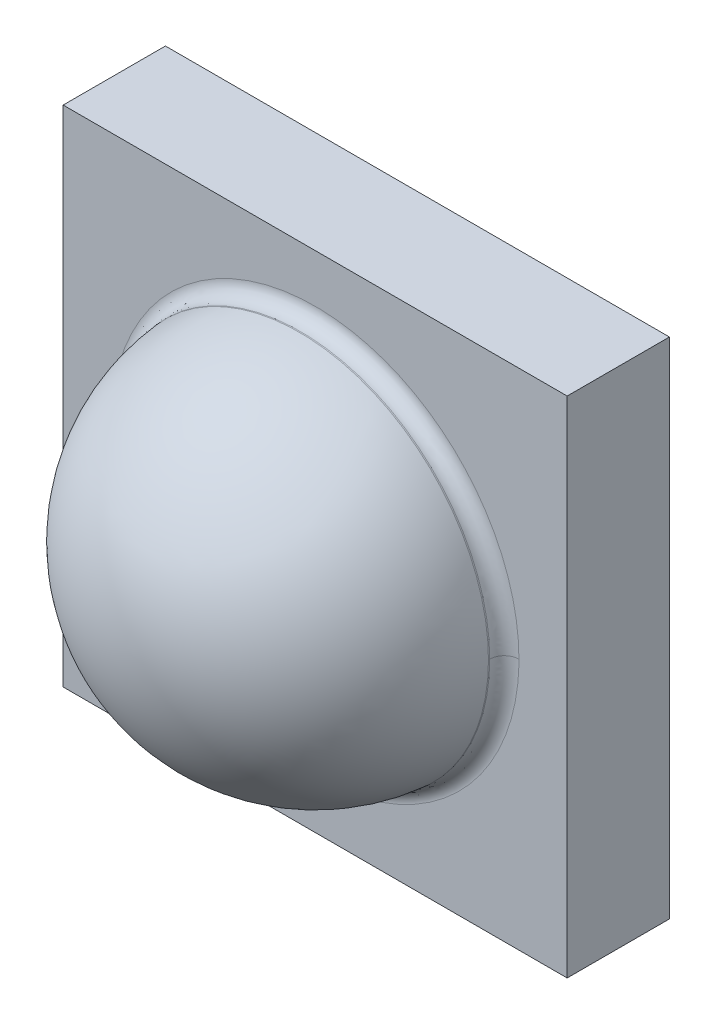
ISO-10303-21;
HEADER;
FILE_DESCRIPTION(('STEP AP214'),'2;1');
FILE_NAME('part.step','',(''),(''),'','','');
FILE_SCHEMA(('AUTOMOTIVE_DESIGN { 1 0 10303 214 1 1 1 1 }'));
ENDSEC;
DATA;
#1=APPLICATION_CONTEXT('core data for automotive mechanical design processes');
#2=APPLICATION_PROTOCOL_DEFINITION('international standard','automotive_design',2000,#1);
#3=PRODUCT_CONTEXT('',#1,'mechanical');
#4=PRODUCT('Part','Part','',(#3));
#5=PRODUCT_RELATED_PRODUCT_CATEGORY('part','',(#4));
#6=PRODUCT_DEFINITION_FORMATION('','',#4);
#7=PRODUCT_DEFINITION_CONTEXT('part definition',#1,'design');
#8=PRODUCT_DEFINITION('design','',#6,#7);
#9=PRODUCT_DEFINITION_SHAPE('','',#8);
#10=(LENGTH_UNIT() NAMED_UNIT(*) SI_UNIT(.MILLI.,.METRE.));
#11=(NAMED_UNIT(*) PLANE_ANGLE_UNIT() SI_UNIT($,.RADIAN.));
#12=(NAMED_UNIT(*) SI_UNIT($,.STERADIAN.) SOLID_ANGLE_UNIT());
#13=UNCERTAINTY_MEASURE_WITH_UNIT(LENGTH_MEASURE(1.E-05),#10,'distance_accuracy_value','');
#14=(GEOMETRIC_REPRESENTATION_CONTEXT(3) GLOBAL_UNCERTAINTY_ASSIGNED_CONTEXT((#13)) GLOBAL_UNIT_ASSIGNED_CONTEXT((#10,
#11,#12)) REPRESENTATION_CONTEXT('',''));
#15=CARTESIAN_POINT('',(0.,0.,0.));
#16=DIRECTION('',(0.,0.,1.));
#17=DIRECTION('',(1.,0.,0.));
#18=AXIS2_PLACEMENT_3D('',#15,#16,#17);
#19=CARTESIAN_POINT('',(-1.125,-1.625,-0.63));
#20=DIRECTION('',(0.,0.,-1.));
#21=DIRECTION('',(-1.,0.,0.));
#22=AXIS2_PLACEMENT_3D('',#19,#20,#21);
#23=PLANE('',#22);
#24=DIRECTION('',(0.,1.,0.));
#25=VECTOR('',#24,1.);
#26=CARTESIAN_POINT('',(-1.625,0.,-0.63));
#27=LINE('',#26,#25);
#28=CARTESIAN_POINT('',(-1.625,-1.625,-0.63));
#29=VERTEX_POINT('',#28);
#30=CARTESIAN_POINT('',(-1.625,1.625,-0.63));
#31=VERTEX_POINT('',#30);
#32=EDGE_CURVE('E425',#29,#31,#27,.T.);
#33=ORIENTED_EDGE('',*,*,#32,.T.);
#34=DIRECTION('',(1.,0.,0.));
#35=VECTOR('',#34,1.);
#36=CARTESIAN_POINT('',(-1.375,1.625,-0.63));
#37=LINE('',#36,#35);
#38=CARTESIAN_POINT('',(-1.125,1.625,-0.63));
#39=VERTEX_POINT('',#38);
#40=EDGE_CURVE('E420',#31,#39,#37,.T.);
#41=ORIENTED_EDGE('',*,*,#40,.T.);
#42=DIRECTION('',(0.,-1.,0.));
#43=VECTOR('',#42,1.);
#44=CARTESIAN_POINT('',(-1.125,0.,-0.63));
#45=LINE('',#44,#43);
#46=CARTESIAN_POINT('',(-1.125,-1.625,-0.63));
#47=VERTEX_POINT('',#46);
#48=EDGE_CURVE('E414',#39,#47,#45,.T.);
#49=ORIENTED_EDGE('',*,*,#48,.T.);
#50=DIRECTION('',(-1.,0.,0.));
#51=VECTOR('',#50,1.);
#52=CARTESIAN_POINT('',(-1.375,-1.625,-0.63));
#53=LINE('',#52,#51);
#54=EDGE_CURVE('E426',#47,#29,#53,.T.);
#55=ORIENTED_EDGE('',*,*,#54,.T.);
#56=EDGE_LOOP('',(#33,#41,#49,#55));
#57=FACE_BOUND('',#56,.T.);
#58=ADVANCED_FACE('F16',(#57),#23,.T.);
#59=CARTESIAN_POINT('',(1.625,-1.625,-0.63));
#60=DIRECTION('',(0.,0.,-1.));
#61=DIRECTION('',(-1.,0.,0.));
#62=AXIS2_PLACEMENT_3D('',#59,#60,#61);
#63=PLANE('',#62);
#64=DIRECTION('',(0.,1.,0.));
#65=VECTOR('',#64,1.);
#66=CARTESIAN_POINT('',(1.125,0.,-0.63));
#67=LINE('',#66,#65);
#68=CARTESIAN_POINT('',(1.125,-1.625,-0.63));
#69=VERTEX_POINT('',#68);
#70=CARTESIAN_POINT('',(1.125,1.625,-0.63));
#71=VERTEX_POINT('',#70);
#72=EDGE_CURVE('E401',#69,#71,#67,.T.);
#73=ORIENTED_EDGE('',*,*,#72,.T.);
#74=DIRECTION('',(1.,0.,0.));
#75=VECTOR('',#74,1.);
#76=CARTESIAN_POINT('',(1.275,1.625,-0.63));
#77=LINE('',#76,#75);
#78=CARTESIAN_POINT('',(1.425,1.625,-0.63));
#79=VERTEX_POINT('',#78);
#80=EDGE_CURVE('E396',#71,#79,#77,.T.);
#81=ORIENTED_EDGE('',*,*,#80,.T.);
#82=DIRECTION('',(0.624695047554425,-0.78086880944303,0.));
#83=VECTOR('',#82,1.);
#84=CARTESIAN_POINT('',(1.525,1.5,-0.63));
#85=LINE('',#84,#83);
#86=CARTESIAN_POINT('',(1.625,1.3749999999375,-0.63));
#87=VERTEX_POINT('',#86);
#88=EDGE_CURVE('E394',#79,#87,#85,.T.);
#89=ORIENTED_EDGE('',*,*,#88,.T.);
#90=DIRECTION('',(0.,-1.,0.));
#91=VECTOR('',#90,1.);
#92=CARTESIAN_POINT('',(1.625,-0.125,-0.63));
#93=LINE('',#92,#91);
#94=CARTESIAN_POINT('',(1.625,-1.625,-0.63));
#95=VERTEX_POINT('',#94);
#96=EDGE_CURVE('E159',#87,#95,#93,.T.);
#97=ORIENTED_EDGE('',*,*,#96,.T.);
#98=DIRECTION('',(-1.,0.,0.));
#99=VECTOR('',#98,1.);
#100=CARTESIAN_POINT('',(1.375,-1.625,-0.63));
#101=LINE('',#100,#99);
#102=EDGE_CURVE('E406',#95,#69,#101,.T.);
#103=ORIENTED_EDGE('',*,*,#102,.T.);
#104=EDGE_LOOP('',(#73,#81,#89,#97,#103));
#105=FACE_BOUND('',#104,.T.);
#106=ADVANCED_FACE('F637',(#105),#63,.T.);
#107=CARTESIAN_POINT('',(0.625,-1.625,-0.63));
#108=DIRECTION('',(0.,0.,-1.));
#109=DIRECTION('',(-1.,0.,0.));
#110=AXIS2_PLACEMENT_3D('',#107,#108,#109);
#111=PLANE('',#110);
#112=DIRECTION('',(0.,1.,0.));
#113=VECTOR('',#112,1.);
#114=CARTESIAN_POINT('',(-0.625,0.,-0.63));
#115=LINE('',#114,#113);
#116=CARTESIAN_POINT('',(-0.625,-1.625,-0.63));
#117=VERTEX_POINT('',#116);
#118=CARTESIAN_POINT('',(-0.625,1.625,-0.63));
#119=VERTEX_POINT('',#118);
#120=EDGE_CURVE('E371',#117,#119,#115,.T.);
#121=ORIENTED_EDGE('',*,*,#120,.T.);
#122=DIRECTION('',(1.,0.,0.));
#123=VECTOR('',#122,1.);
#124=CARTESIAN_POINT('',(0.,1.625,-0.63));
#125=LINE('',#124,#123);
#126=CARTESIAN_POINT('',(0.625,1.625,-0.63));
#127=VERTEX_POINT('',#126);
#128=EDGE_CURVE('E390',#119,#127,#125,.T.);
#129=ORIENTED_EDGE('',*,*,#128,.T.);
#130=DIRECTION('',(0.,-1.,0.));
#131=VECTOR('',#130,1.);
#132=CARTESIAN_POINT('',(0.625,0.,-0.63));
#133=LINE('',#132,#131);
#134=CARTESIAN_POINT('',(0.625,-1.625,-0.63));
#135=VERTEX_POINT('',#134);
#136=EDGE_CURVE('E385',#127,#135,#133,.T.);
#137=ORIENTED_EDGE('',*,*,#136,.T.);
#138=DIRECTION('',(-1.,0.,0.));
#139=VECTOR('',#138,1.);
#140=CARTESIAN_POINT('',(0.,-1.625,-0.63));
#141=LINE('',#140,#139);
#142=EDGE_CURVE('E380',#135,#117,#141,.T.);
#143=ORIENTED_EDGE('',*,*,#142,.T.);
#144=EDGE_LOOP('',(#121,#129,#137,#143));
#145=FACE_BOUND('',#144,.T.);
#146=ADVANCED_FACE('F452',(#145),#111,.T.);
#147=CARTESIAN_POINT('',(-1.625,-1.625,-0.57));
#148=DIRECTION('',(1.,0.,0.));
#149=DIRECTION('',(0.,0.,-1.));
#150=AXIS2_PLACEMENT_3D('',#147,#148,#149);
#151=PLANE('',#150);
#152=DIRECTION('',(0.,0.,1.));
#153=VECTOR('',#152,1.);
#154=CARTESIAN_POINT('',(-1.625,-1.625,-0.6));
#155=LINE('',#154,#153);
#156=CARTESIAN_POINT('',(-1.6250000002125,-1.6250000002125,-0.57));
#157=VERTEX_POINT('',#156);
#158=EDGE_CURVE('E411',#29,#157,#155,.T.);
#159=ORIENTED_EDGE('',*,*,#158,.T.);
#160=DIRECTION('',(0.,1.,0.));
#161=VECTOR('',#160,1.);
#162=CARTESIAN_POINT('',(-1.62500000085,0.,-0.57));
#163=LINE('',#162,#161);
#164=CARTESIAN_POINT('',(-1.6250000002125,1.6250000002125,-0.57));
#165=VERTEX_POINT('',#164);
#166=EDGE_CURVE('E368',#157,#165,#163,.T.);
#167=ORIENTED_EDGE('',*,*,#166,.T.);
#168=DIRECTION('',(0.,0.,-1.));
#169=VECTOR('',#168,1.);
#170=CARTESIAN_POINT('',(-1.625,1.625,-0.6));
#171=LINE('',#170,#169);
#172=EDGE_CURVE('E422',#165,#31,#171,.T.);
#173=ORIENTED_EDGE('',*,*,#172,.T.);
#174=ORIENTED_EDGE('',*,*,#32,.F.);
#175=EDGE_LOOP('',(#159,#167,#173,#174));
#176=FACE_BOUND('',#175,.T.);
#177=ADVANCED_FACE('F434',(#176),#151,.F.);
#178=CARTESIAN_POINT('',(-1.125,1.625,-0.63));
#179=DIRECTION('',(0.,-1.,0.));
#180=DIRECTION('',(0.,0.,1.));
#181=AXIS2_PLACEMENT_3D('',#178,#179,#180);
#182=PLANE('',#181);
#183=ORIENTED_EDGE('',*,*,#172,.F.);
#184=DIRECTION('',(1.,0.,0.));
#185=VECTOR('',#184,1.);
#186=CARTESIAN_POINT('',(0.,1.62500000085,-0.57));
#187=LINE('',#186,#185);
#188=CARTESIAN_POINT('',(-1.1250000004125,1.6250000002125,-0.57));
#189=VERTEX_POINT('',#188);
#190=EDGE_CURVE('E365',#165,#189,#187,.T.);
#191=ORIENTED_EDGE('',*,*,#190,.T.);
#192=DIRECTION('',(0.,0.,-1.));
#193=VECTOR('',#192,1.);
#194=CARTESIAN_POINT('',(-1.125,1.625,-0.6));
#195=LINE('',#194,#193);
#196=EDGE_CURVE('E417',#189,#39,#195,.T.);
#197=ORIENTED_EDGE('',*,*,#196,.T.);
#198=ORIENTED_EDGE('',*,*,#40,.F.);
#199=EDGE_LOOP('',(#183,#191,#197,#198));
#200=FACE_BOUND('',#199,.T.);
#201=ADVANCED_FACE('F443',(#200),#182,.F.);
#202=CARTESIAN_POINT('',(-1.125,-1.625,-0.63));
#203=DIRECTION('',(-1.,0.,0.));
#204=DIRECTION('',(0.,0.,1.));
#205=AXIS2_PLACEMENT_3D('',#202,#203,#204);
#206=PLANE('',#205);
#207=ORIENTED_EDGE('',*,*,#196,.F.);
#208=DIRECTION('',(0.,-1.,0.));
#209=VECTOR('',#208,1.);
#210=CARTESIAN_POINT('',(-1.12500000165,0.,-0.57));
#211=LINE('',#210,#209);
#212=CARTESIAN_POINT('',(-1.1250000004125,-1.6250000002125,-0.57));
#213=VERTEX_POINT('',#212);
#214=EDGE_CURVE('E362',#189,#213,#211,.T.);
#215=ORIENTED_EDGE('',*,*,#214,.T.);
#216=DIRECTION('',(0.,0.,-1.));
#217=VECTOR('',#216,1.);
#218=CARTESIAN_POINT('',(-1.125,-1.625,-0.6));
#219=LINE('',#218,#217);
#220=EDGE_CURVE('E408',#213,#47,#219,.T.);
#221=ORIENTED_EDGE('',*,*,#220,.T.);
#222=ORIENTED_EDGE('',*,*,#48,.F.);
#223=EDGE_LOOP('',(#207,#215,#221,#222));
#224=FACE_BOUND('',#223,.T.);
#225=ADVANCED_FACE('F441',(#224),#206,.F.);
#226=CARTESIAN_POINT('',(-1.125,-1.625,-0.57));
#227=DIRECTION('',(0.,1.,0.));
#228=DIRECTION('',(0.,0.,-1.));
#229=AXIS2_PLACEMENT_3D('',#226,#227,#228);
#230=PLANE('',#229);
#231=ORIENTED_EDGE('',*,*,#220,.F.);
#232=DIRECTION('',(-1.,0.,0.));
#233=VECTOR('',#232,1.);
#234=CARTESIAN_POINT('',(0.,-1.62500000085,-0.57));
#235=LINE('',#234,#233);
#236=EDGE_CURVE('E359',#213,#157,#235,.T.);
#237=ORIENTED_EDGE('',*,*,#236,.T.);
#238=ORIENTED_EDGE('',*,*,#158,.F.);
#239=ORIENTED_EDGE('',*,*,#54,.F.);
#240=EDGE_LOOP('',(#231,#237,#238,#239));
#241=FACE_BOUND('',#240,.T.);
#242=ADVANCED_FACE('F435',(#241),#230,.F.);
#243=CARTESIAN_POINT('',(1.625,-1.625,-0.57));
#244=DIRECTION('',(0.,1.,0.));
#245=DIRECTION('',(0.,0.,-1.));
#246=AXIS2_PLACEMENT_3D('',#243,#244,#245);
#247=PLANE('',#246);
#248=DIRECTION('',(0.,0.,1.));
#249=VECTOR('',#248,1.);
#250=CARTESIAN_POINT('',(1.625,-1.625,-0.6));
#251=LINE('',#250,#249);
#252=CARTESIAN_POINT('',(1.6250000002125,-1.6250000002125,-0.57));
#253=VERTEX_POINT('',#252);
#254=EDGE_CURVE('E160',#95,#253,#251,.T.);
#255=ORIENTED_EDGE('',*,*,#254,.T.);
#256=DIRECTION('',(-1.,0.,0.));
#257=VECTOR('',#256,1.);
#258=CARTESIAN_POINT('',(0.,-1.62500000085,-0.57));
#259=LINE('',#258,#257);
#260=CARTESIAN_POINT('',(1.1250000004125,-1.6250000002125,-0.57));
#261=VERTEX_POINT('',#260);
#262=EDGE_CURVE('E169',#253,#261,#259,.T.);
#263=ORIENTED_EDGE('',*,*,#262,.T.);
#264=DIRECTION('',(0.,0.,-1.));
#265=VECTOR('',#264,1.);
#266=CARTESIAN_POINT('',(1.125,-1.625,-0.6));
#267=LINE('',#266,#265);
#268=EDGE_CURVE('E403',#261,#69,#267,.T.);
#269=ORIENTED_EDGE('',*,*,#268,.T.);
#270=ORIENTED_EDGE('',*,*,#102,.F.);
#271=EDGE_LOOP('',(#255,#263,#269,#270));
#272=FACE_BOUND('',#271,.T.);
#273=ADVANCED_FACE('F458',(#272),#247,.F.);
#274=CARTESIAN_POINT('',(1.125,-1.625,-0.57));
#275=DIRECTION('',(1.,0.,0.));
#276=DIRECTION('',(0.,0.,-1.));
#277=AXIS2_PLACEMENT_3D('',#274,#275,#276);
#278=PLANE('',#277);
#279=ORIENTED_EDGE('',*,*,#268,.F.);
#280=DIRECTION('',(0.,1.,0.));
#281=VECTOR('',#280,1.);
#282=CARTESIAN_POINT('',(1.12500000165,0.,-0.57));
#283=LINE('',#282,#281);
#284=CARTESIAN_POINT('',(1.1250000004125,1.6250000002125,-0.57));
#285=VERTEX_POINT('',#284);
#286=EDGE_CURVE('E175',#261,#285,#283,.T.);
#287=ORIENTED_EDGE('',*,*,#286,.T.);
#288=DIRECTION('',(0.,0.,-1.));
#289=VECTOR('',#288,1.);
#290=CARTESIAN_POINT('',(1.125,1.625,-0.6));
#291=LINE('',#290,#289);
#292=EDGE_CURVE('E398',#285,#71,#291,.T.);
#293=ORIENTED_EDGE('',*,*,#292,.T.);
#294=ORIENTED_EDGE('',*,*,#72,.F.);
#295=EDGE_LOOP('',(#279,#287,#293,#294));
#296=FACE_BOUND('',#295,.T.);
#297=ADVANCED_FACE('F461',(#296),#278,.F.);
#298=CARTESIAN_POINT('',(1.425,1.625,-0.63));
#299=DIRECTION('',(0.,-1.,0.));
#300=DIRECTION('',(0.,0.,1.));
#301=AXIS2_PLACEMENT_3D('',#298,#299,#300);
#302=PLANE('',#301);
#303=ORIENTED_EDGE('',*,*,#292,.F.);
#304=DIRECTION('',(1.,0.,0.));
#305=VECTOR('',#304,1.);
#306=CARTESIAN_POINT('',(0.,1.62500000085,-0.57));
#307=LINE('',#306,#305);
#308=CARTESIAN_POINT('',(1.42499999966,1.625000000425,-0.57));
#309=VERTEX_POINT('',#308);
#310=EDGE_CURVE('E174',#285,#309,#307,.T.);
#311=ORIENTED_EDGE('',*,*,#310,.T.);
#312=DIRECTION('',(0.,0.,-1.));
#313=VECTOR('',#312,1.);
#314=CARTESIAN_POINT('',(1.425,1.625,-0.6));
#315=LINE('',#314,#313);
#316=EDGE_CURVE('E146',#309,#79,#315,.T.);
#317=ORIENTED_EDGE('',*,*,#316,.T.);
#318=ORIENTED_EDGE('',*,*,#80,.F.);
#319=EDGE_LOOP('',(#303,#311,#317,#318));
#320=FACE_BOUND('',#319,.T.);
#321=ADVANCED_FACE('F465',(#320),#302,.F.);
#322=CARTESIAN_POINT('',(1.625,1.375,-0.57));
#323=DIRECTION('',(-0.78086880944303,-0.624695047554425,0.));
#324=DIRECTION('',(-0.624695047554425,0.78086880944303,0.));
#325=AXIS2_PLACEMENT_3D('',#322,#323,#324);
#326=PLANE('',#325);
#327=ORIENTED_EDGE('',*,*,#316,.F.);
#328=DIRECTION('',(-0.624695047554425,0.78086880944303,0.));
#329=VECTOR('',#328,1.);
#330=CARTESIAN_POINT('',(1.625,1.375,-0.57));
#331=LINE('',#330,#329);
#332=CARTESIAN_POINT('',(1.625000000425,1.37499999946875,-0.57));
#333=VERTEX_POINT('',#332);
#334=EDGE_CURVE('E21',#309,#333,#331,.F.);
#335=ORIENTED_EDGE('',*,*,#334,.T.);
#336=DIRECTION('',(0.,0.,-1.));
#337=VECTOR('',#336,1.);
#338=CARTESIAN_POINT('',(1.625,1.375,-0.6));
#339=LINE('',#338,#337);
#340=EDGE_CURVE('E153',#333,#87,#339,.T.);
#341=ORIENTED_EDGE('',*,*,#340,.T.);
#342=ORIENTED_EDGE('',*,*,#88,.F.);
#343=EDGE_LOOP('',(#327,#335,#341,#342));
#344=FACE_BOUND('',#343,.T.);
#345=ADVANCED_FACE('F173',(#344),#326,.F.);
#346=CARTESIAN_POINT('',(1.625,-1.625,-0.63));
#347=DIRECTION('',(-1.,0.,0.));
#348=DIRECTION('',(0.,0.,1.));
#349=AXIS2_PLACEMENT_3D('',#346,#347,#348);
#350=PLANE('',#349);
#351=ORIENTED_EDGE('',*,*,#340,.F.);
#352=DIRECTION('',(0.,-1.,0.));
#353=VECTOR('',#352,1.);
#354=CARTESIAN_POINT('',(1.62500000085,0.,-0.57));
#355=LINE('',#354,#353);
#356=EDGE_CURVE('E157',#333,#253,#355,.T.);
#357=ORIENTED_EDGE('',*,*,#356,.T.);
#358=ORIENTED_EDGE('',*,*,#254,.F.);
#359=ORIENTED_EDGE('',*,*,#96,.F.);
#360=EDGE_LOOP('',(#351,#357,#358,#359));
#361=FACE_BOUND('',#360,.T.);
#362=ADVANCED_FACE('F155',(#361),#350,.F.);
#363=CARTESIAN_POINT('',(0.625,1.625,-0.57));
#364=DIRECTION('',(0.,-1.,0.));
#365=DIRECTION('',(-1.,0.,0.));
#366=AXIS2_PLACEMENT_3D('',#363,#364,#365);
#367=PLANE('',#366);
#368=DIRECTION('',(0.,0.,1.));
#369=VECTOR('',#368,1.);
#370=CARTESIAN_POINT('',(-0.625,1.625,-0.6));
#371=LINE('',#370,#369);
#372=CARTESIAN_POINT('',(-0.62499999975,1.6250000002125,-0.57));
#373=VERTEX_POINT('',#372);
#374=EDGE_CURVE('E377',#119,#373,#371,.T.);
#375=ORIENTED_EDGE('',*,*,#374,.T.);
#376=DIRECTION('',(1.,0.,0.));
#377=VECTOR('',#376,1.);
#378=CARTESIAN_POINT('',(0.,1.62500000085,-0.57));
#379=LINE('',#378,#377);
#380=CARTESIAN_POINT('',(0.62499999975,1.6250000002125,-0.57));
#381=VERTEX_POINT('',#380);
#382=EDGE_CURVE('E171',#373,#381,#379,.T.);
#383=ORIENTED_EDGE('',*,*,#382,.T.);
#384=DIRECTION('',(0.,0.,-1.));
#385=VECTOR('',#384,1.);
#386=CARTESIAN_POINT('',(0.625,1.625,-0.6));
#387=LINE('',#386,#385);
#388=EDGE_CURVE('E387',#381,#127,#387,.T.);
#389=ORIENTED_EDGE('',*,*,#388,.T.);
#390=ORIENTED_EDGE('',*,*,#128,.F.);
#391=EDGE_LOOP('',(#375,#383,#389,#390));
#392=FACE_BOUND('',#391,.T.);
#393=ADVANCED_FACE('F473',(#392),#367,.F.);
#394=CARTESIAN_POINT('',(0.625,-1.625,-0.63));
#395=DIRECTION('',(-1.,0.,0.));
#396=DIRECTION('',(0.,0.,1.));
#397=AXIS2_PLACEMENT_3D('',#394,#395,#396);
#398=PLANE('',#397);
#399=ORIENTED_EDGE('',*,*,#388,.F.);
#400=DIRECTION('',(0.,-1.,0.));
#401=VECTOR('',#400,1.);
#402=CARTESIAN_POINT('',(0.624999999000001,0.,-0.57));
#403=LINE('',#402,#401);
#404=CARTESIAN_POINT('',(0.62499999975,-1.6250000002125,-0.57));
#405=VERTEX_POINT('',#404);
#406=EDGE_CURVE('E353',#381,#405,#403,.T.);
#407=ORIENTED_EDGE('',*,*,#406,.T.);
#408=DIRECTION('',(0.,0.,-1.));
#409=VECTOR('',#408,1.);
#410=CARTESIAN_POINT('',(0.625,-1.625,-0.6));
#411=LINE('',#410,#409);
#412=EDGE_CURVE('E382',#405,#135,#411,.T.);
#413=ORIENTED_EDGE('',*,*,#412,.T.);
#414=ORIENTED_EDGE('',*,*,#136,.F.);
#415=EDGE_LOOP('',(#399,#407,#413,#414));
#416=FACE_BOUND('',#415,.T.);
#417=ADVANCED_FACE('F476',(#416),#398,.F.);
#418=CARTESIAN_POINT('',(-0.625,-1.625,-0.57));
#419=DIRECTION('',(0.,1.,0.));
#420=DIRECTION('',(1.,0.,0.));
#421=AXIS2_PLACEMENT_3D('',#418,#419,#420);
#422=PLANE('',#421);
#423=ORIENTED_EDGE('',*,*,#412,.F.);
#424=DIRECTION('',(-1.,0.,0.));
#425=VECTOR('',#424,1.);
#426=CARTESIAN_POINT('',(0.,-1.62500000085,-0.57));
#427=LINE('',#426,#425);
#428=CARTESIAN_POINT('',(-0.62499999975,-1.6250000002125,-0.57));
#429=VERTEX_POINT('',#428);
#430=EDGE_CURVE('E350',#405,#429,#427,.T.);
#431=ORIENTED_EDGE('',*,*,#430,.T.);
#432=DIRECTION('',(0.,0.,-1.));
#433=VECTOR('',#432,1.);
#434=CARTESIAN_POINT('',(-0.625,-1.625,-0.6));
#435=LINE('',#434,#433);
#436=EDGE_CURVE('E374',#429,#117,#435,.T.);
#437=ORIENTED_EDGE('',*,*,#436,.T.);
#438=ORIENTED_EDGE('',*,*,#142,.F.);
#439=EDGE_LOOP('',(#423,#431,#437,#438));
#440=FACE_BOUND('',#439,.T.);
#441=ADVANCED_FACE('F480',(#440),#422,.F.);
#442=CARTESIAN_POINT('',(-0.625,-1.625,-0.57));
#443=DIRECTION('',(1.,0.,0.));
#444=DIRECTION('',(0.,0.,-1.));
#445=AXIS2_PLACEMENT_3D('',#442,#443,#444);
#446=PLANE('',#445);
#447=ORIENTED_EDGE('',*,*,#436,.F.);
#448=DIRECTION('',(0.,1.,0.));
#449=VECTOR('',#448,1.);
#450=CARTESIAN_POINT('',(-0.624999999,0.,-0.57));
#451=LINE('',#450,#449);
#452=EDGE_CURVE('E347',#429,#373,#451,.T.);
#453=ORIENTED_EDGE('',*,*,#452,.T.);
#454=ORIENTED_EDGE('',*,*,#374,.F.);
#455=ORIENTED_EDGE('',*,*,#120,.F.);
#456=EDGE_LOOP('',(#447,#453,#454,#455));
#457=FACE_BOUND('',#456,.T.);
#458=ADVANCED_FACE('F484',(#457),#446,.F.);
#459=CARTESIAN_POINT('',(-1.725,-1.725,-0.57));
#460=DIRECTION('',(0.,0.,1.));
#461=DIRECTION('',(1.,0.,0.));
#462=AXIS2_PLACEMENT_3D('',#459,#460,#461);
#463=PLANE('',#462);
#464=ORIENTED_EDGE('',*,*,#430,.F.);
#465=ORIENTED_EDGE('',*,*,#406,.F.);
#466=ORIENTED_EDGE('',*,*,#382,.F.);
#467=ORIENTED_EDGE('',*,*,#452,.F.);
#468=EDGE_LOOP('',(#464,#465,#466,#467));
#469=FACE_BOUND('',#468,.T.);
#470=ORIENTED_EDGE('',*,*,#334,.F.);
#471=ORIENTED_EDGE('',*,*,#310,.F.);
#472=ORIENTED_EDGE('',*,*,#286,.F.);
#473=ORIENTED_EDGE('',*,*,#262,.F.);
#474=ORIENTED_EDGE('',*,*,#356,.F.);
#475=EDGE_LOOP('',(#470,#471,#472,#473,#474));
#476=FACE_BOUND('',#475,.T.);
#477=ORIENTED_EDGE('',*,*,#214,.F.);
#478=ORIENTED_EDGE('',*,*,#190,.F.);
#479=ORIENTED_EDGE('',*,*,#166,.F.);
#480=ORIENTED_EDGE('',*,*,#236,.F.);
#481=EDGE_LOOP('',(#477,#478,#479,#480));
#482=FACE_BOUND('',#481,.T.);
#483=DIRECTION('',(-1.,0.,0.));
#484=VECTOR('',#483,1.);
#485=CARTESIAN_POINT('',(0.,-1.725,-0.57));
#486=LINE('',#485,#484);
#487=CARTESIAN_POINT('',(1.725,-1.725,-0.57));
#488=VERTEX_POINT('',#487);
#489=CARTESIAN_POINT('',(-1.725,-1.725,-0.57));
#490=VERTEX_POINT('',#489);
#491=EDGE_CURVE('E338',#488,#490,#486,.T.);
#492=ORIENTED_EDGE('',*,*,#491,.T.);
#493=DIRECTION('',(0.,1.,0.));
#494=VECTOR('',#493,1.);
#495=CARTESIAN_POINT('',(-1.725,0.,-0.57));
#496=LINE('',#495,#494);
#497=CARTESIAN_POINT('',(-1.725,1.725,-0.57));
#498=VERTEX_POINT('',#497);
#499=EDGE_CURVE('E341',#490,#498,#496,.T.);
#500=ORIENTED_EDGE('',*,*,#499,.T.);
#501=DIRECTION('',(1.,0.,0.));
#502=VECTOR('',#501,1.);
#503=CARTESIAN_POINT('',(0.,1.725,-0.57));
#504=LINE('',#503,#502);
#505=CARTESIAN_POINT('',(1.725,1.725,-0.57));
#506=VERTEX_POINT('',#505);
#507=EDGE_CURVE('E344',#498,#506,#504,.T.);
#508=ORIENTED_EDGE('',*,*,#507,.T.);
#509=DIRECTION('',(0.,-1.,0.));
#510=VECTOR('',#509,1.);
#511=CARTESIAN_POINT('',(1.725,0.,-0.57));
#512=LINE('',#511,#510);
#513=EDGE_CURVE('E320',#506,#488,#512,.T.);
#514=ORIENTED_EDGE('',*,*,#513,.T.);
#515=EDGE_LOOP('',(#492,#500,#508,#514));
#516=FACE_BOUND('',#515,.T.);
#517=ADVANCED_FACE('F163',(#469,#476,#482,#516),#463,.F.);
#518=CARTESIAN_POINT('',(1.296819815,0.,0.24899082));
#519=CARTESIAN_POINT('',(1.296819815,-2.59363963,0.24899082));
#520=CARTESIAN_POINT('',(-1.296819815,-2.59363963,0.24899082));
#521=CARTESIAN_POINT('',(-1.296819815,0.,0.24899082));
#522=CARTESIAN_POINT('',(1.294970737,0.,0.239431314));
#523=CARTESIAN_POINT('',(1.294970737,-2.589941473,0.239431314));
#524=CARTESIAN_POINT('',(-1.294970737,-2.589941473,0.239431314));
#525=CARTESIAN_POINT('',(-1.294970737,0.,0.239431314));
#526=CARTESIAN_POINT('',(1.294527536,0.,0.229704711));
#527=CARTESIAN_POINT('',(1.294527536,-2.589055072,0.229704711));
#528=CARTESIAN_POINT('',(-1.294527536,-2.589055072,0.229704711));
#529=CARTESIAN_POINT('',(-1.294527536,0.,0.229704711));
#530=CARTESIAN_POINT('',(1.295499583,0.,0.220016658));
#531=CARTESIAN_POINT('',(1.295499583,-2.590999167,0.220016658));
#532=CARTESIAN_POINT('',(-1.295499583,-2.590999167,0.220016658));
#533=CARTESIAN_POINT('',(-1.295499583,0.,0.220016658));
#534=(BOUNDED_SURFACE() B_SPLINE_SURFACE(3,3,((#518,#519,#520,#521),(#522,#523,#524,#525),(#526,
#527,#528,#529),(#530,#531,#532,#533)),.UNSPECIFIED.,.F.,.F.,
.F.) B_SPLINE_SURFACE_WITH_KNOTS((4,4),(4,4),(0.,1.),(0.,1.),
.UNSPECIFIED.) GEOMETRIC_REPRESENTATION_ITEM() RATIONAL_B_SPLINE_SURFACE(((1.,0.333333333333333,
0.333333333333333,1.),(0.992952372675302,0.330984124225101,0.330984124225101,0.992952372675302),
(0.992952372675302,0.330984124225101,0.330984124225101,0.992952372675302),(1.,0.333333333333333,
0.333333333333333,1.))) REPRESENTATION_ITEM('') SURFACE());
#535=CARTESIAN_POINT('',(1.296819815,0.,0.24899082));
#536=CARTESIAN_POINT('',(1.294970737,0.,0.239431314));
#537=CARTESIAN_POINT('',(1.294527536,0.,0.229704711));
#538=CARTESIAN_POINT('',(1.295499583,0.,0.220016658));
#539=(BOUNDED_CURVE() B_SPLINE_CURVE(3,(#535,#536,#537,#538),.UNSPECIFIED.,.F.,
.F.) B_SPLINE_CURVE_WITH_KNOTS((4,4),(0.,1.),
.UNSPECIFIED.) CURVE() GEOMETRIC_REPRESENTATION_ITEM() RATIONAL_B_SPLINE_CURVE((1.,
0.992952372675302,0.992952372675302,1.)) REPRESENTATION_ITEM(''));
#540=CARTESIAN_POINT('',(1.29541438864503,0.,0.239094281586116));
#541=VERTEX_POINT('',#540);
#542=CARTESIAN_POINT('',(1.29499999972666,0.,0.230000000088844));
#543=VERTEX_POINT('',#542);
#544=EDGE_CURVE('E309',#541,#543,#539,.T.);
#545=CARTESIAN_POINT('',(0.,0.,0.239094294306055));
#546=DIRECTION('',(0.,0.,-1.));
#547=DIRECTION('',(-1.,0.,0.));
#548=AXIS2_PLACEMENT_3D('',#545,#546,#547);
#549=CIRCLE('',#548,1.29541438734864);
#550=CARTESIAN_POINT('',(-1.29541438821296,-3.87732457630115E-11,0.239094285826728));
#551=VERTEX_POINT('',#550);
#552=EDGE_CURVE('E301',#541,#551,#549,.T.);
#553=CARTESIAN_POINT('',(-1.296819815,0.,0.24899082));
#554=CARTESIAN_POINT('',(-1.294970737,0.,0.239431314));
#555=CARTESIAN_POINT('',(-1.294527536,0.,0.229704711));
#556=CARTESIAN_POINT('',(-1.295499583,0.,0.220016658));
#557=(BOUNDED_CURVE() B_SPLINE_CURVE(3,(#553,#554,#555,#556),.UNSPECIFIED.,.F.,
.F.) B_SPLINE_CURVE_WITH_KNOTS((4,4),(0.,1.),
.UNSPECIFIED.) CURVE() GEOMETRIC_REPRESENTATION_ITEM() RATIONAL_B_SPLINE_CURVE((1.,
0.992952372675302,0.992952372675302,1.)) REPRESENTATION_ITEM(''));
#558=CARTESIAN_POINT('',(-1.29499999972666,0.,0.230000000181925));
#559=VERTEX_POINT('',#558);
#560=EDGE_CURVE('E311',#559,#551,#557,.F.);
#561=CARTESIAN_POINT('',(0.,0.,0.230000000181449));
#562=DIRECTION('',(0.,0.,1.));
#563=DIRECTION('',(0.,-1.,0.));
#564=AXIS2_PLACEMENT_3D('',#561,#562,#563);
#565=CIRCLE('',#564,1.29499999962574);
#566=EDGE_CURVE('E277',#559,#543,#565,.T.);
#567=ORIENTED_EDGE('',*,*,#544,.F.);
#568=ORIENTED_EDGE('',*,*,#552,.T.);
#569=ORIENTED_EDGE('',*,*,#560,.F.);
#570=ORIENTED_EDGE('',*,*,#566,.T.);
#571=EDGE_LOOP('',(#567,#568,#569,#570));
#572=FACE_BOUND('',#571,.T.);
#573=ADVANCED_FACE('F258',(#572),#534,.F.);
#574=CARTESIAN_POINT('',(1.725,1.725,0.13));
#575=DIRECTION('',(0.,1.,0.));
#576=DIRECTION('',(0.,0.,-1.));
#577=AXIS2_PLACEMENT_3D('',#574,#575,#576);
#578=PLANE('',#577);
#579=DIRECTION('',(0.,0.,1.));
#580=VECTOR('',#579,1.);
#581=CARTESIAN_POINT('',(1.725,1.725,0.065));
#582=LINE('',#581,#580);
#583=CARTESIAN_POINT('',(1.725,1.725,0.13));
#584=VERTEX_POINT('',#583);
#585=EDGE_CURVE('E286',#506,#584,#582,.T.);
#586=ORIENTED_EDGE('',*,*,#585,.F.);
#587=ORIENTED_EDGE('',*,*,#507,.F.);
#588=DIRECTION('',(0.,0.,-1.));
#589=VECTOR('',#588,1.);
#590=CARTESIAN_POINT('',(-1.725,1.725,0.065));
#591=LINE('',#590,#589);
#592=CARTESIAN_POINT('',(-1.725,1.725,0.13));
#593=VERTEX_POINT('',#592);
#594=EDGE_CURVE('E300',#593,#498,#591,.T.);
#595=ORIENTED_EDGE('',*,*,#594,.F.);
#596=DIRECTION('',(-1.,0.,0.));
#597=VECTOR('',#596,1.);
#598=CARTESIAN_POINT('',(0.,1.725,0.13));
#599=LINE('',#598,#597);
#600=EDGE_CURVE('E214',#584,#593,#599,.T.);
#601=ORIENTED_EDGE('',*,*,#600,.F.);
#602=EDGE_LOOP('',(#586,#587,#595,#601));
#603=FACE_BOUND('',#602,.T.);
#604=ADVANCED_FACE('F492',(#603),#578,.T.);
#605=CARTESIAN_POINT('',(-1.725,-1.725,0.));
#606=DIRECTION('',(-1.,0.,0.));
#607=DIRECTION('',(0.,0.,1.));
#608=AXIS2_PLACEMENT_3D('',#605,#606,#607);
#609=PLANE('',#608);
#610=ORIENTED_EDGE('',*,*,#594,.T.);
#611=ORIENTED_EDGE('',*,*,#499,.F.);
#612=DIRECTION('',(0.,0.,-1.));
#613=VECTOR('',#612,1.);
#614=CARTESIAN_POINT('',(-1.725,-1.725,0.065));
#615=LINE('',#614,#613);
#616=CARTESIAN_POINT('',(-1.725,-1.725,0.13));
#617=VERTEX_POINT('',#616);
#618=EDGE_CURVE('E298',#617,#490,#615,.T.);
#619=ORIENTED_EDGE('',*,*,#618,.F.);
#620=DIRECTION('',(0.,-1.,0.));
#621=VECTOR('',#620,1.);
#622=CARTESIAN_POINT('',(-1.725,0.,0.13));
#623=LINE('',#622,#621);
#624=EDGE_CURVE('E527',#593,#617,#623,.T.);
#625=ORIENTED_EDGE('',*,*,#624,.F.);
#626=EDGE_LOOP('',(#610,#611,#619,#625));
#627=FACE_BOUND('',#626,.T.);
#628=ADVANCED_FACE('F495',(#627),#609,.T.);
#629=CARTESIAN_POINT('',(1.725,-1.725,0.));
#630=DIRECTION('',(0.,-1.,0.));
#631=DIRECTION('',(0.,0.,1.));
#632=AXIS2_PLACEMENT_3D('',#629,#630,#631);
#633=PLANE('',#632);
#634=ORIENTED_EDGE('',*,*,#618,.T.);
#635=ORIENTED_EDGE('',*,*,#491,.F.);
#636=DIRECTION('',(0.,0.,-1.));
#637=VECTOR('',#636,1.);
#638=CARTESIAN_POINT('',(1.725,-1.725,0.065));
#639=LINE('',#638,#637);
#640=CARTESIAN_POINT('',(1.725,-1.725,0.13));
#641=VERTEX_POINT('',#640);
#642=EDGE_CURVE('E296',#641,#488,#639,.T.);
#643=ORIENTED_EDGE('',*,*,#642,.F.);
#644=DIRECTION('',(1.,0.,0.));
#645=VECTOR('',#644,1.);
#646=CARTESIAN_POINT('',(0.,-1.725,0.13));
#647=LINE('',#646,#645);
#648=EDGE_CURVE('E525',#617,#641,#647,.T.);
#649=ORIENTED_EDGE('',*,*,#648,.F.);
#650=EDGE_LOOP('',(#634,#635,#643,#649));
#651=FACE_BOUND('',#650,.T.);
#652=ADVANCED_FACE('F499',(#651),#633,.T.);
#653=CARTESIAN_POINT('',(1.725,-1.725,0.13));
#654=DIRECTION('',(1.,0.,0.));
#655=DIRECTION('',(0.,0.,-1.));
#656=AXIS2_PLACEMENT_3D('',#653,#654,#655);
#657=PLANE('',#656);
#658=ORIENTED_EDGE('',*,*,#642,.T.);
#659=ORIENTED_EDGE('',*,*,#513,.F.);
#660=ORIENTED_EDGE('',*,*,#585,.T.);
#661=DIRECTION('',(0.,1.,0.));
#662=VECTOR('',#661,1.);
#663=CARTESIAN_POINT('',(1.725,0.,0.13));
#664=LINE('',#663,#662);
#665=EDGE_CURVE('E207',#641,#584,#664,.T.);
#666=ORIENTED_EDGE('',*,*,#665,.F.);
#667=EDGE_LOOP('',(#658,#659,#660,#666));
#668=FACE_BOUND('',#667,.T.);
#669=ADVANCED_FACE('F257',(#668),#657,.T.);
#670=CARTESIAN_POINT('',(1.295499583,0.,0.239983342));
#671=CARTESIAN_POINT('',(1.295499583,-2.590999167,0.239983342));
#672=CARTESIAN_POINT('',(-1.295499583,-2.590999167,0.239983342));
#673=CARTESIAN_POINT('',(-1.295499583,0.,0.239983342));
#674=CARTESIAN_POINT('',(1.288677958,0.,0.171994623));
#675=CARTESIAN_POINT('',(1.288677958,-2.577355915,0.171994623));
#676=CARTESIAN_POINT('',(-1.288677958,-2.577355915,0.171994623));
#677=CARTESIAN_POINT('',(-1.288677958,0.,0.171994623));
#678=CARTESIAN_POINT('',(1.336994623,0.,0.123677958));
#679=CARTESIAN_POINT('',(1.336994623,-2.673989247,0.123677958));
#680=CARTESIAN_POINT('',(-1.336994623,-2.673989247,0.123677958));
#681=CARTESIAN_POINT('',(-1.336994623,0.,0.123677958));
#682=CARTESIAN_POINT('',(1.404983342,0.,0.130499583));
#683=CARTESIAN_POINT('',(1.404983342,-2.809966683,0.130499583));
#684=CARTESIAN_POINT('',(-1.404983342,-2.809966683,0.130499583));
#685=CARTESIAN_POINT('',(-1.404983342,0.,0.130499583));
#686=(BOUNDED_SURFACE() B_SPLINE_SURFACE(3,3,((#670,#671,#672,#673),(#674,#675,#676,#677),(#678,
#679,#680,#681),(#682,#683,#684,#685)),.UNSPECIFIED.,.F.,.F.,
.F.) B_SPLINE_SURFACE_WITH_KNOTS((4,4),(4,4),(0.,1.),(0.,1.),
.UNSPECIFIED.) GEOMETRIC_REPRESENTATION_ITEM() RATIONAL_B_SPLINE_SURFACE(((1.,0.333333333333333,
0.333333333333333,1.),(0.755320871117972,0.251773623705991,0.251773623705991,0.755320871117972),
(0.755320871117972,0.251773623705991,0.251773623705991,0.755320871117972),(1.,0.333333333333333,
0.333333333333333,1.))) REPRESENTATION_ITEM('') SURFACE());
#687=CARTESIAN_POINT('',(-1.295499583,0.,0.239983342));
#688=CARTESIAN_POINT('',(-1.288677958,0.,0.171994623));
#689=CARTESIAN_POINT('',(-1.336994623,0.,0.123677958));
#690=CARTESIAN_POINT('',(-1.404983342,0.,0.130499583));
#691=(BOUNDED_CURVE() B_SPLINE_CURVE(3,(#687,#688,#689,#690),.UNSPECIFIED.,.F.,
.F.) B_SPLINE_CURVE_WITH_KNOTS((4,4),(0.,1.),
.UNSPECIFIED.) CURVE() GEOMETRIC_REPRESENTATION_ITEM() RATIONAL_B_SPLINE_CURVE((1.,
0.755320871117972,0.755320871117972,1.)) REPRESENTATION_ITEM(''));
#692=CARTESIAN_POINT('',(-1.39500000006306,0.,0.129999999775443));
#693=VERTEX_POINT('',#692);
#694=EDGE_CURVE('E211',#693,#559,#691,.F.);
#695=CARTESIAN_POINT('',(-1.39500000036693,0.,0.129999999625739));
#696=CARTESIAN_POINT('',(-1.39500000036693,-2.78999999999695,0.129999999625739));
#697=CARTESIAN_POINT('',(1.39500000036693,-2.78999999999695,0.129999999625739));
#698=CARTESIAN_POINT('',(1.39500000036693,0.,0.129999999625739));
#699=(BOUNDED_CURVE() B_SPLINE_CURVE(3,(#695,#696,#697,#698),.UNSPECIFIED.,.F.,
.F.) B_SPLINE_CURVE_WITH_KNOTS((4,4),(0.,1.),
.UNSPECIFIED.) CURVE() GEOMETRIC_REPRESENTATION_ITEM() RATIONAL_B_SPLINE_CURVE((0.956578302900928,
0.318859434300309,0.318859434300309,0.956578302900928)) REPRESENTATION_ITEM(''));
#700=CARTESIAN_POINT('',(1.39500000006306,0.,0.129999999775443));
#701=VERTEX_POINT('',#700);
#702=EDGE_CURVE('E195',#701,#693,#699,.F.);
#703=CARTESIAN_POINT('',(1.295499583,0.,0.239983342));
#704=CARTESIAN_POINT('',(1.288677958,0.,0.171994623));
#705=CARTESIAN_POINT('',(1.336994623,0.,0.123677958));
#706=CARTESIAN_POINT('',(1.404983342,0.,0.130499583));
#707=(BOUNDED_CURVE() B_SPLINE_CURVE(3,(#703,#704,#705,#706),.UNSPECIFIED.,.F.,
.F.) B_SPLINE_CURVE_WITH_KNOTS((4,4),(0.,1.),
.UNSPECIFIED.) CURVE() GEOMETRIC_REPRESENTATION_ITEM() RATIONAL_B_SPLINE_CURVE((1.,
0.755320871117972,0.755320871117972,1.)) REPRESENTATION_ITEM(''));
#708=EDGE_CURVE('E36',#543,#701,#707,.T.);
#709=ORIENTED_EDGE('',*,*,#566,.F.);
#710=ORIENTED_EDGE('',*,*,#694,.F.);
#711=ORIENTED_EDGE('',*,*,#702,.F.);
#712=ORIENTED_EDGE('',*,*,#708,.F.);
#713=EDGE_LOOP('',(#709,#710,#711,#712));
#714=FACE_BOUND('',#713,.T.);
#715=ADVANCED_FACE('F250',(#714),#686,.F.);
#716=CARTESIAN_POINT('',(0.,0.,0.13));
#717=DIRECTION('',(0.,0.,-1.));
#718=DIRECTION('',(1.,0.,0.));
#719=AXIS2_PLACEMENT_3D('',#716,#717,#718);
#720=SPHERICAL_SURFACE('',#719,1.3);
#721=CARTESIAN_POINT('',(0.,0.,1.43));
#722=VERTEX_POINT('',#721);
#723=VERTEX_LOOP('',#722);
#724=FACE_BOUND('',#723,.T.);
#725=ORIENTED_EDGE('',*,*,#552,.F.);
#726=CARTESIAN_POINT('',(0.,0.,0.239094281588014));
#727=DIRECTION('',(0.,0.,1.));
#728=DIRECTION('',(0.,-1.,0.));
#729=AXIS2_PLACEMENT_3D('',#726,#727,#728);
#730=CIRCLE('',#729,1.2954143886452);
#731=EDGE_CURVE('E206',#541,#551,#730,.T.);
#732=ORIENTED_EDGE('',*,*,#731,.T.);
#733=EDGE_LOOP('',(#725,#732));
#734=FACE_BOUND('',#733,.T.);
#735=ADVANCED_FACE('F242',(#724,#734),#720,.T.);
#736=CARTESIAN_POINT('',(-1.725,-1.725,0.13));
#737=DIRECTION('',(0.,0.,1.));
#738=DIRECTION('',(1.,0.,0.));
#739=AXIS2_PLACEMENT_3D('',#736,#737,#738);
#740=PLANE('',#739);
#741=CARTESIAN_POINT('',(1.39500000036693,0.,0.129999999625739));
#742=CARTESIAN_POINT('',(1.39500000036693,2.78999999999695,0.129999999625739));
#743=CARTESIAN_POINT('',(-1.39500000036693,2.78999999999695,0.129999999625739));
#744=CARTESIAN_POINT('',(-1.39500000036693,0.,0.129999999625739));
#745=(BOUNDED_CURVE() B_SPLINE_CURVE(3,(#741,#742,#743,#744),.UNSPECIFIED.,.F.,
.F.) B_SPLINE_CURVE_WITH_KNOTS((4,4),(0.,1.),
.UNSPECIFIED.) CURVE() GEOMETRIC_REPRESENTATION_ITEM() RATIONAL_B_SPLINE_CURVE((0.956578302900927,
0.318859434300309,0.318859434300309,0.956578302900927)) REPRESENTATION_ITEM(''));
#746=EDGE_CURVE('E27',#693,#701,#745,.F.);
#747=ORIENTED_EDGE('',*,*,#746,.T.);
#748=ORIENTED_EDGE('',*,*,#702,.T.);
#749=EDGE_LOOP('',(#747,#748));
#750=FACE_BOUND('',#749,.T.);
#751=ORIENTED_EDGE('',*,*,#648,.T.);
#752=ORIENTED_EDGE('',*,*,#665,.T.);
#753=ORIENTED_EDGE('',*,*,#600,.T.);
#754=ORIENTED_EDGE('',*,*,#624,.T.);
#755=EDGE_LOOP('',(#751,#752,#753,#754));
#756=FACE_BOUND('',#755,.T.);
#757=ADVANCED_FACE('F18',(#750,#756),#740,.T.);
#758=CARTESIAN_POINT('',(-1.296819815,0.,0.24899082));
#759=CARTESIAN_POINT('',(-1.296819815,2.59363963,0.24899082));
#760=CARTESIAN_POINT('',(1.296819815,2.59363963,0.24899082));
#761=CARTESIAN_POINT('',(1.296819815,0.,0.24899082));
#762=CARTESIAN_POINT('',(-1.294970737,0.,0.239431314));
#763=CARTESIAN_POINT('',(-1.294970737,2.589941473,0.239431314));
#764=CARTESIAN_POINT('',(1.294970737,2.589941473,0.239431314));
#765=CARTESIAN_POINT('',(1.294970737,0.,0.239431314));
#766=CARTESIAN_POINT('',(-1.294527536,0.,0.229704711));
#767=CARTESIAN_POINT('',(-1.294527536,2.589055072,0.229704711));
#768=CARTESIAN_POINT('',(1.294527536,2.589055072,0.229704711));
#769=CARTESIAN_POINT('',(1.294527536,0.,0.229704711));
#770=CARTESIAN_POINT('',(-1.295499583,0.,0.220016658));
#771=CARTESIAN_POINT('',(-1.295499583,2.590999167,0.220016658));
#772=CARTESIAN_POINT('',(1.295499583,2.590999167,0.220016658));
#773=CARTESIAN_POINT('',(1.295499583,0.,0.220016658));
#774=(BOUNDED_SURFACE() B_SPLINE_SURFACE(3,3,((#758,#759,#760,#761),(#762,#763,#764,#765),(#766,
#767,#768,#769),(#770,#771,#772,#773)),.UNSPECIFIED.,.F.,.F.,
.F.) B_SPLINE_SURFACE_WITH_KNOTS((4,4),(4,4),(0.,1.),(0.,1.),
.UNSPECIFIED.) GEOMETRIC_REPRESENTATION_ITEM() RATIONAL_B_SPLINE_SURFACE(((1.,0.333333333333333,
0.333333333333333,1.),(0.992952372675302,0.330984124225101,0.330984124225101,0.992952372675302),
(0.992952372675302,0.330984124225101,0.330984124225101,0.992952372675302),(1.,0.333333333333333,
0.333333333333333,1.))) REPRESENTATION_ITEM('') SURFACE());
#775=CARTESIAN_POINT('',(0.,0.,0.230000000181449));
#776=DIRECTION('',(0.,0.,1.));
#777=DIRECTION('',(0.,-1.,0.));
#778=AXIS2_PLACEMENT_3D('',#775,#776,#777);
#779=CIRCLE('',#778,1.29499999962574);
#780=EDGE_CURVE('E10',#543,#559,#779,.T.);
#781=ORIENTED_EDGE('',*,*,#560,.T.);
#782=ORIENTED_EDGE('',*,*,#731,.F.);
#783=ORIENTED_EDGE('',*,*,#544,.T.);
#784=ORIENTED_EDGE('',*,*,#780,.T.);
#785=EDGE_LOOP('',(#781,#782,#783,#784));
#786=FACE_BOUND('',#785,.T.);
#787=ADVANCED_FACE('F231',(#786),#774,.F.);
#788=CARTESIAN_POINT('',(-1.295499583,0.,0.239983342));
#789=CARTESIAN_POINT('',(-1.295499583,2.590999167,0.239983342));
#790=CARTESIAN_POINT('',(1.295499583,2.590999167,0.239983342));
#791=CARTESIAN_POINT('',(1.295499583,0.,0.239983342));
#792=CARTESIAN_POINT('',(-1.288677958,0.,0.171994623));
#793=CARTESIAN_POINT('',(-1.288677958,2.577355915,0.171994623));
#794=CARTESIAN_POINT('',(1.288677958,2.577355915,0.171994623));
#795=CARTESIAN_POINT('',(1.288677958,0.,0.171994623));
#796=CARTESIAN_POINT('',(-1.336994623,0.,0.123677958));
#797=CARTESIAN_POINT('',(-1.336994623,2.673989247,0.123677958));
#798=CARTESIAN_POINT('',(1.336994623,2.673989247,0.123677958));
#799=CARTESIAN_POINT('',(1.336994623,0.,0.123677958));
#800=CARTESIAN_POINT('',(-1.404983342,0.,0.130499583));
#801=CARTESIAN_POINT('',(-1.404983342,2.809966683,0.130499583));
#802=CARTESIAN_POINT('',(1.404983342,2.809966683,0.130499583));
#803=CARTESIAN_POINT('',(1.404983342,0.,0.130499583));
#804=(BOUNDED_SURFACE() B_SPLINE_SURFACE(3,3,((#788,#789,#790,#791),(#792,#793,#794,#795),(#796,
#797,#798,#799),(#800,#801,#802,#803)),.UNSPECIFIED.,.F.,.F.,
.F.) B_SPLINE_SURFACE_WITH_KNOTS((4,4),(4,4),(0.,1.),(0.,1.),
.UNSPECIFIED.) GEOMETRIC_REPRESENTATION_ITEM() RATIONAL_B_SPLINE_SURFACE(((1.,0.333333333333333,
0.333333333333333,1.),(0.755320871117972,0.251773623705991,0.251773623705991,0.755320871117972),
(0.755320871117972,0.251773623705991,0.251773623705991,0.755320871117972),(1.,0.333333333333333,
0.333333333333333,1.))) REPRESENTATION_ITEM('') SURFACE());
#805=ORIENTED_EDGE('',*,*,#780,.F.);
#806=ORIENTED_EDGE('',*,*,#708,.T.);
#807=ORIENTED_EDGE('',*,*,#746,.F.);
#808=ORIENTED_EDGE('',*,*,#694,.T.);
#809=EDGE_LOOP('',(#805,#806,#807,#808));
#810=FACE_BOUND('',#809,.T.);
#811=ADVANCED_FACE('F210',(#810),#804,.F.);
#812=CLOSED_SHELL('',(#58,#106,#146,#177,#201,#225,#242,#273,#297,#321,#345,#362,#393,#417,#441,
#458,#517,#573,#604,#628,#652,#669,#715,#735,#757,#787,#811));
#813=MANIFOLD_SOLID_BREP('B1',#812);
#814=ADVANCED_BREP_SHAPE_REPRESENTATION('',(#18,#813),#14);
#815=SHAPE_DEFINITION_REPRESENTATION(#9,#814);
ENDSEC;
END-ISO-10303-21;
